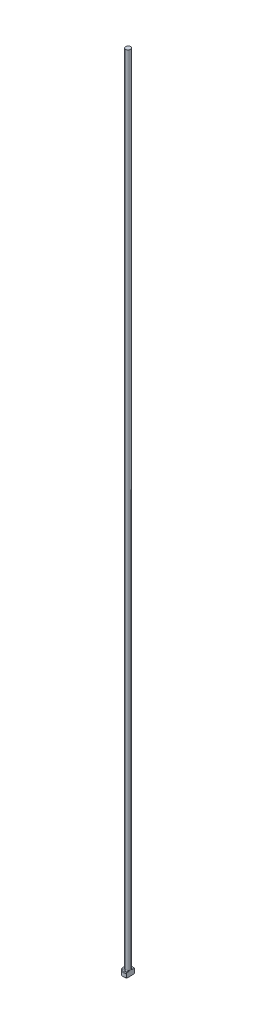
ISO-10303-21;
HEADER;
FILE_DESCRIPTION(('STEP AP214'),'2;1');
FILE_NAME('part.step','',(''),(''),'','','');
FILE_SCHEMA(('AUTOMOTIVE_DESIGN { 1 0 10303 214 1 1 1 1 }'));
ENDSEC;
DATA;
#1=APPLICATION_CONTEXT('core data for automotive mechanical design processes');
#2=APPLICATION_PROTOCOL_DEFINITION('international standard','automotive_design',2000,#1);
#3=PRODUCT_CONTEXT('',#1,'mechanical');
#4=PRODUCT('Part','Part','',(#3));
#5=PRODUCT_RELATED_PRODUCT_CATEGORY('part','',(#4));
#6=PRODUCT_DEFINITION_FORMATION('','',#4);
#7=PRODUCT_DEFINITION_CONTEXT('part definition',#1,'design');
#8=PRODUCT_DEFINITION('design','',#6,#7);
#9=PRODUCT_DEFINITION_SHAPE('','',#8);
#10=(LENGTH_UNIT() NAMED_UNIT(*) SI_UNIT(.MILLI.,.METRE.));
#11=(NAMED_UNIT(*) PLANE_ANGLE_UNIT() SI_UNIT($,.RADIAN.));
#12=(NAMED_UNIT(*) SI_UNIT($,.STERADIAN.) SOLID_ANGLE_UNIT());
#13=UNCERTAINTY_MEASURE_WITH_UNIT(LENGTH_MEASURE(1.E-05),#10,'distance_accuracy_value','');
#14=(GEOMETRIC_REPRESENTATION_CONTEXT(3) GLOBAL_UNCERTAINTY_ASSIGNED_CONTEXT((#13)) GLOBAL_UNIT_ASSIGNED_CONTEXT((#10,
#11,#12)) REPRESENTATION_CONTEXT('',''));
#15=CARTESIAN_POINT('',(0.,0.,0.));
#16=DIRECTION('',(0.,0.,1.));
#17=DIRECTION('',(1.,0.,0.));
#18=AXIS2_PLACEMENT_3D('',#15,#16,#17);
#19=CARTESIAN_POINT('',(0.,0.,0.));
#20=DIRECTION('',(0.,-1.,0.));
#21=DIRECTION('',(0.,0.,-1.));
#22=AXIS2_PLACEMENT_3D('',#19,#20,#21);
#23=PLANE('',#22);
#24=CARTESIAN_POINT('',(0.,0.,0.));
#25=DIRECTION('',(0.,-1.,0.));
#26=DIRECTION('',(0.,0.,-1.));
#27=AXIS2_PLACEMENT_3D('',#24,#25,#26);
#28=CIRCLE('',#27,1.29999999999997);
#29=CARTESIAN_POINT('',(0.749999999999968,0.,1.06183802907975));
#30=VERTEX_POINT('',#29);
#31=CARTESIAN_POINT('',(0.749999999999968,0.,-1.06183802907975));
#32=VERTEX_POINT('',#31);
#33=EDGE_CURVE('E98',#30,#32,#28,.T.);
#34=ORIENTED_EDGE('',*,*,#33,.T.);
#35=DIRECTION('',(0.,0.,1.));
#36=VECTOR('',#35,1.);
#37=CARTESIAN_POINT('',(0.749999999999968,0.,-1.29903810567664));
#38=LINE('',#37,#36);
#39=EDGE_CURVE('E83',#32,#30,#38,.T.);
#40=ORIENTED_EDGE('',*,*,#39,.T.);
#41=EDGE_LOOP('',(#34,#40));
#42=FACE_BOUND('',#41,.T.);
#43=ADVANCED_FACE('F32',(#42),#23,.T.);
#44=CARTESIAN_POINT('',(0.,259.958771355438,0.));
#45=DIRECTION('',(0.,1.,0.));
#46=DIRECTION('',(0.,0.,1.));
#47=AXIS2_PLACEMENT_3D('',#44,#45,#46);
#48=CYLINDRICAL_SURFACE('',#47,1.49999999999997);
#49=CARTESIAN_POINT('',(0.,1.29999999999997,0.));
#50=DIRECTION('',(0.,1.,0.));
#51=DIRECTION('',(0.,0.,1.));
#52=AXIS2_PLACEMENT_3D('',#49,#50,#51);
#53=CIRCLE('',#52,1.49999999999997);
#54=CARTESIAN_POINT('',(0.749999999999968,1.29999999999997,1.29903810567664));
#55=VERTEX_POINT('',#54);
#56=CARTESIAN_POINT('',(0.749999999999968,1.29999999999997,-1.29903810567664));
#57=VERTEX_POINT('',#56);
#58=EDGE_CURVE('E104',#55,#57,#53,.F.);
#59=ORIENTED_EDGE('',*,*,#58,.T.);
#60=DIRECTION('',(0.,-1.,0.));
#61=VECTOR('',#60,1.);
#62=CARTESIAN_POINT('',(0.749999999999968,250.,-1.29903810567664));
#63=LINE('',#62,#61);
#64=CARTESIAN_POINT('',(0.749999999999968,0.199999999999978,-1.29903810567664));
#65=VERTEX_POINT('',#64);
#66=EDGE_CURVE('E183',#57,#65,#63,.T.);
#67=ORIENTED_EDGE('',*,*,#66,.T.);
#68=CARTESIAN_POINT('',(0.,0.199999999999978,0.));
#69=DIRECTION('',(0.,-1.,0.));
#70=DIRECTION('',(0.,0.,-1.));
#71=AXIS2_PLACEMENT_3D('',#68,#69,#70);
#72=CIRCLE('',#71,1.49999999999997);
#73=CARTESIAN_POINT('',(0.749999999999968,0.199999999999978,1.29903810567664));
#74=VERTEX_POINT('',#73);
#75=EDGE_CURVE('E100',#65,#74,#72,.F.);
#76=ORIENTED_EDGE('',*,*,#75,.T.);
#77=DIRECTION('',(0.,-1.,0.));
#78=VECTOR('',#77,1.);
#79=CARTESIAN_POINT('',(0.749999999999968,250.,1.29903810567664));
#80=LINE('',#79,#78);
#81=EDGE_CURVE('E93',#55,#74,#80,.T.);
#82=ORIENTED_EDGE('',*,*,#81,.F.);
#83=EDGE_LOOP('',(#59,#67,#76,#82));
#84=FACE_BOUND('',#83,.T.);
#85=ADVANCED_FACE('F158',(#84),#48,.T.);
#86=CARTESIAN_POINT('',(-1.49999999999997,1.5,0.));
#87=DIRECTION('',(0.,1.,0.));
#88=DIRECTION('',(0.,0.,1.));
#89=AXIS2_PLACEMENT_3D('',#86,#87,#88);
#90=PLANE('',#89);
#91=CARTESIAN_POINT('',(0.,1.5,0.));
#92=DIRECTION('',(0.,1.,0.));
#93=DIRECTION('',(0.,0.,1.));
#94=AXIS2_PLACEMENT_3D('',#91,#92,#93);
#95=CIRCLE('',#94,1.29999999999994);
#96=CARTESIAN_POINT('',(0.749999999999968,1.5,-1.06183802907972));
#97=VERTEX_POINT('',#96);
#98=CARTESIAN_POINT('',(0.749999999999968,1.5,1.06183802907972));
#99=VERTEX_POINT('',#98);
#100=EDGE_CURVE('E178',#97,#99,#95,.T.);
#101=ORIENTED_EDGE('',*,*,#100,.T.);
#102=DIRECTION('',(0.,0.,-1.));
#103=VECTOR('',#102,1.);
#104=CARTESIAN_POINT('',(0.749999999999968,1.5,0.));
#105=LINE('',#104,#103);
#106=CARTESIAN_POINT('',(0.749999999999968,1.49999999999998,0.583095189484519));
#107=VERTEX_POINT('',#106);
#108=EDGE_CURVE('E57',#99,#107,#105,.T.);
#109=ORIENTED_EDGE('',*,*,#108,.T.);
#110=CARTESIAN_POINT('',(0.,1.5,0.));
#111=DIRECTION('',(0.,1.,0.));
#112=DIRECTION('',(0.,0.,1.));
#113=AXIS2_PLACEMENT_3D('',#110,#111,#112);
#114=CIRCLE('',#113,0.949999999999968);
#115=CARTESIAN_POINT('',(0.749999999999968,1.49999999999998,-0.583095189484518));
#116=VERTEX_POINT('',#115);
#117=EDGE_CURVE('E107',#107,#116,#114,.F.);
#118=ORIENTED_EDGE('',*,*,#117,.T.);
#119=EDGE_CURVE('E136',#116,#97,#105,.T.);
#120=ORIENTED_EDGE('',*,*,#119,.T.);
#121=EDGE_LOOP('',(#101,#109,#118,#120));
#122=FACE_BOUND('',#121,.T.);
#123=ADVANCED_FACE('F147',(#122),#90,.T.);
#124=CARTESIAN_POINT('',(0.,1.5,0.));
#125=DIRECTION('',(0.,-1.,0.));
#126=DIRECTION('',(0.,0.,-1.));
#127=AXIS2_PLACEMENT_3D('',#124,#125,#126);
#128=CONICAL_SURFACE('',#127,1.29999999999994,0.785398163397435);
#129=ORIENTED_EDGE('',*,*,#58,.F.);
#130=CARTESIAN_POINT('',(0.749999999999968,-0.159311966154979,2.86269581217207));
#131=CARTESIAN_POINT('',(0.749999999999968,-0.0964328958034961,2.79769204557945));
#132=CARTESIAN_POINT('',(0.749999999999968,-0.033622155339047,2.73262201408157));
#133=CARTESIAN_POINT('',(0.749999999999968,0.0918244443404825,2.60231208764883));
#134=CARTESIAN_POINT('',(0.749999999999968,0.154460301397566,2.53707219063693));
#135=CARTESIAN_POINT('',(0.749999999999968,0.342109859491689,2.34097725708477));
#136=CARTESIAN_POINT('',(0.749999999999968,0.466801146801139,2.20981339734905));
#137=CARTESIAN_POINT('',(0.749999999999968,0.712328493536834,1.9488034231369));
#138=CARTESIAN_POINT('',(0.749999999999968,0.833191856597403,1.81898315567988));
#139=CARTESIAN_POINT('',(0.749999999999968,1.01264761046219,1.62259577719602));
#140=CARTESIAN_POINT('',(0.749999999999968,1.07215326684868,1.55686440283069));
#141=CARTESIAN_POINT('',(0.749999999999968,1.19029260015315,1.42462307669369));
#142=CARTESIAN_POINT('',(0.749999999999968,1.24892630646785,1.35811315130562));
#143=CARTESIAN_POINT('',(0.749999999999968,1.34237202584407,1.25003987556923));
#144=CARTESIAN_POINT('',(0.749999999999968,1.37758720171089,1.20882554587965));
#145=CARTESIAN_POINT('',(0.749999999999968,1.44738925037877,1.12585980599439));
#146=CARTESIAN_POINT('',(0.749999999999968,1.48197606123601,1.08410834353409));
#147=CARTESIAN_POINT('',(0.749999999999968,1.55066668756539,0.999475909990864));
#148=CARTESIAN_POINT('',(0.749999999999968,1.58476158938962,0.956587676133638));
#149=CARTESIAN_POINT('',(0.749999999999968,1.65176028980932,0.869892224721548));
#150=CARTESIAN_POINT('',(0.749999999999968,1.68466421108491,0.826085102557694));
#151=CARTESIAN_POINT('',(0.749999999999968,1.74926316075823,0.736563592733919));
#152=CARTESIAN_POINT('',(0.749999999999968,1.78093229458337,0.690830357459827));
#153=CARTESIAN_POINT('',(0.749999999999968,1.84170221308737,0.597569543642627));
#154=CARTESIAN_POINT('',(0.749999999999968,1.87079946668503,0.550039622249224));
#155=CARTESIAN_POINT('',(0.749999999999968,1.92458416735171,0.45327502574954));
#156=CARTESIAN_POINT('',(0.749999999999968,1.94932190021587,0.404068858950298));
#157=CARTESIAN_POINT('',(0.749999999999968,1.9924017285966,0.302953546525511));
#158=CARTESIAN_POINT('',(0.749999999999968,2.01076529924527,0.251054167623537));
#159=CARTESIAN_POINT('',(0.749999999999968,2.03062801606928,0.173219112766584));
#160=CARTESIAN_POINT('',(0.749999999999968,2.03589389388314,0.148243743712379));
#161=CARTESIAN_POINT('',(0.749999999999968,2.04404463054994,0.0979002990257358));
#162=CARTESIAN_POINT('',(0.749999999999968,2.04692969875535,0.0725322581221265));
#163=CARTESIAN_POINT('',(0.749999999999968,2.05011277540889,0.0217085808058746));
#164=CARTESIAN_POINT('',(0.749999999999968,2.05041870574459,-0.0037465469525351));
#165=CARTESIAN_POINT('',(0.749999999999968,2.04844884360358,-0.054551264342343));
#166=CARTESIAN_POINT('',(0.749999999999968,2.04617283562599,-0.0799008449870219));
#167=CARTESIAN_POINT('',(0.749999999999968,2.03574038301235,-0.154989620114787));
#168=CARTESIAN_POINT('',(0.749999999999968,2.02400532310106,-0.204255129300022));
#169=CARTESIAN_POINT('',(0.749999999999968,2.00101199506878,-0.276434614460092));
#170=CARTESIAN_POINT('',(0.749999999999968,1.99241146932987,-0.300284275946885));
#171=CARTESIAN_POINT('',(0.749999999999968,1.97373056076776,-0.347397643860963));
#172=CARTESIAN_POINT('',(0.749999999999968,1.96365048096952,-0.37066146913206));
#173=CARTESIAN_POINT('',(0.749999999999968,1.93147369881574,-0.439916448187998));
#174=CARTESIAN_POINT('',(0.749999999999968,1.90754987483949,-0.485052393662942));
#175=CARTESIAN_POINT('',(0.749999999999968,1.85653851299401,-0.573518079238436));
#176=CARTESIAN_POINT('',(0.749999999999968,1.8294470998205,-0.616845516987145));
#177=CARTESIAN_POINT('',(0.749999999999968,1.77305281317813,-0.702247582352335));
#178=CARTESIAN_POINT('',(0.749999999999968,1.74374234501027,-0.744317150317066));
#179=CARTESIAN_POINT('',(0.749999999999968,1.68364081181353,-0.827390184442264));
#180=CARTESIAN_POINT('',(0.749999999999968,1.65284939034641,-0.868393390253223));
#181=CARTESIAN_POINT('',(0.749999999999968,1.5581158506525,-0.991236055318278));
#182=CARTESIAN_POINT('',(0.749999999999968,1.49256261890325,-1.07182756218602));
#183=CARTESIAN_POINT('',(0.749999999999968,1.35929153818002,-1.23084604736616));
#184=CARTESIAN_POINT('',(0.749999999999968,1.29157909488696,-1.30927763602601));
#185=CARTESIAN_POINT('',(0.749999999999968,1.16634991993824,-1.45163734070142));
#186=CARTESIAN_POINT('',(0.749999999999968,1.10905780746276,-1.51576342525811));
#187=CARTESIAN_POINT('',(0.749999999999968,0.993771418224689,-1.64338257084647));
#188=CARTESIAN_POINT('',(0.749999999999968,0.935777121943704,-1.70687561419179));
#189=CARTESIAN_POINT('',(0.749999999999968,0.760930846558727,-1.89677871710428));
#190=CARTESIAN_POINT('',(0.749999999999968,0.643323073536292,-2.02249209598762));
#191=CARTESIAN_POINT('',(0.749999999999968,0.411828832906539,-2.26768837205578));
#192=CARTESIAN_POINT('',(0.749999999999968,0.297988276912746,-2.3872148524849));
#193=CARTESIAN_POINT('',(0.749999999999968,0.0697231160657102,-2.62545352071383));
#194=CARTESIAN_POINT('',(0.749999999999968,-0.0447006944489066,-2.74416646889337));
#195=CARTESIAN_POINT('',(0.749999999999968,-0.159311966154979,-2.86269581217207));
#196=B_SPLINE_CURVE_WITH_KNOTS('',3,(#130,#131,#132,#133,#134,#135,#136,#137,#138,#139,#140,
#141,#142,#143,#144,#145,#146,#147,#148,#149,#150,#151,#152,#153,#154,#155,#156,#157,#158,#159,
#160,#161,#162,#163,#164,#165,#166,#167,#168,#169,#170,#171,#172,#173,#174,#175,#176,#177,#178,
#179,#180,#181,#182,#183,#184,#185,#186,#187,#188,#189,#190,#191,#192,#193,#194,#195),
.UNSPECIFIED.,.F.,.F.,(4,2,2,2,2,2,2,2,2,2,2,2,2,2,2,2,2,2,2,2,2,2,2,2,2,2,2,2,2,2,2,2,4),(0.,
0.271318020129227,0.54263937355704,1.08555961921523,1.61765797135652,1.88364922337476,
2.14963148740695,2.31225703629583,2.47489853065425,2.63925165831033,2.80358780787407,
2.9704157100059,3.13746921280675,3.30244771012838,3.46686485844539,3.54334114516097,
3.61981070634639,3.69604530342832,3.77228626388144,3.9233329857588,3.99936293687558,
4.07537733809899,4.22841106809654,4.38163402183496,4.53540740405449,4.68921798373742,
5.0007773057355,5.31160990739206,5.56957672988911,5.82755073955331,6.34398366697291,
6.83917444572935,7.33381214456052),.UNSPECIFIED.);
#197=EDGE_CURVE('E135',#55,#99,#196,.T.);
#198=ORIENTED_EDGE('',*,*,#197,.T.);
#199=ORIENTED_EDGE('',*,*,#100,.F.);
#200=EDGE_CURVE('E127',#97,#57,#196,.T.);
#201=ORIENTED_EDGE('',*,*,#200,.T.);
#202=EDGE_LOOP('',(#129,#198,#199,#201));
#203=FACE_BOUND('',#202,.T.);
#204=ADVANCED_FACE('F143',(#203),#128,.T.);
#205=CARTESIAN_POINT('',(0.,0.199999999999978,0.));
#206=DIRECTION('',(0.,1.,0.));
#207=DIRECTION('',(0.,0.,1.));
#208=AXIS2_PLACEMENT_3D('',#205,#206,#207);
#209=CONICAL_SURFACE('',#208,1.49999999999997,0.785398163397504);
#210=ORIENTED_EDGE('',*,*,#75,.F.);
#211=CARTESIAN_POINT('',(0.749999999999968,1.65931196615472,-2.86269581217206));
#212=CARTESIAN_POINT('',(0.749999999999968,1.59643289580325,-2.79769204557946));
#213=CARTESIAN_POINT('',(0.749999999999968,1.53362215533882,-2.73262201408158));
#214=CARTESIAN_POINT('',(0.749999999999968,1.40817555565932,-2.60231208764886));
#215=CARTESIAN_POINT('',(0.749999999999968,1.34553969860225,-2.53707219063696));
#216=CARTESIAN_POINT('',(0.749999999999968,1.15789014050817,-2.34097725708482));
#217=CARTESIAN_POINT('',(0.749999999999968,1.03319885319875,-2.20981339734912));
#218=CARTESIAN_POINT('',(0.749999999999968,0.787671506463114,-1.94880342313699));
#219=CARTESIAN_POINT('',(0.749999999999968,0.666808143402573,-1.81898315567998));
#220=CARTESIAN_POINT('',(0.749999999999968,0.487352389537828,-1.62259577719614));
#221=CARTESIAN_POINT('',(0.749999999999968,0.427846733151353,-1.55686440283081));
#222=CARTESIAN_POINT('',(0.749999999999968,0.309707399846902,-1.42462307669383));
#223=CARTESIAN_POINT('',(0.749999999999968,0.251073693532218,-1.35811315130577));
#224=CARTESIAN_POINT('',(0.749999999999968,0.157627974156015,-1.25003987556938));
#225=CARTESIAN_POINT('',(0.749999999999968,0.122412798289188,-1.2088255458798));
#226=CARTESIAN_POINT('',(0.749999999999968,0.0526107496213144,-1.12585980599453));
#227=CARTESIAN_POINT('',(0.749999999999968,0.0180239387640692,-1.08410834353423));
#228=CARTESIAN_POINT('',(0.749999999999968,-0.0506666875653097,-0.999475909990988));
#229=CARTESIAN_POINT('',(0.749999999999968,-0.0847615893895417,-0.956587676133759));
#230=CARTESIAN_POINT('',(0.749999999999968,-0.151760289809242,-0.869892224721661));
#231=CARTESIAN_POINT('',(0.749999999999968,-0.184664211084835,-0.826085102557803));
#232=CARTESIAN_POINT('',(0.749999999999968,-0.249263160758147,-0.73656359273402));
#233=CARTESIAN_POINT('',(0.749999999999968,-0.280932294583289,-0.690830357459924));
#234=CARTESIAN_POINT('',(0.749999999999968,-0.341702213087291,-0.597569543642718));
#235=CARTESIAN_POINT('',(0.749999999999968,-0.370799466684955,-0.550039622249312));
#236=CARTESIAN_POINT('',(0.749999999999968,-0.424584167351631,-0.453275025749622));
#237=CARTESIAN_POINT('',(0.749999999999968,-0.449321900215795,-0.404068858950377));
#238=CARTESIAN_POINT('',(0.749999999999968,-0.492401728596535,-0.302953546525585));
#239=CARTESIAN_POINT('',(0.749999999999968,-0.510765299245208,-0.251054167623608));
#240=CARTESIAN_POINT('',(0.749999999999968,-0.530628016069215,-0.173219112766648));
#241=CARTESIAN_POINT('',(0.749999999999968,-0.53589389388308,-0.148243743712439));
#242=CARTESIAN_POINT('',(0.749999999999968,-0.54404463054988,-0.0979002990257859));
#243=CARTESIAN_POINT('',(0.749999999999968,-0.546929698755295,-0.0725322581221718));
#244=CARTESIAN_POINT('',(0.749999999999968,-0.550112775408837,-0.0217085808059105));
#245=CARTESIAN_POINT('',(0.749999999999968,-0.550418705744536,0.00374654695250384));
#246=CARTESIAN_POINT('',(0.749999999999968,-0.548448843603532,0.0545512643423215));
#247=CARTESIAN_POINT('',(0.749999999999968,-0.546172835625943,0.0799008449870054));
#248=CARTESIAN_POINT('',(0.749999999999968,-0.535740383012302,0.154989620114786));
#249=CARTESIAN_POINT('',(0.749999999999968,-0.524005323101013,0.204255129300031));
#250=CARTESIAN_POINT('',(0.749999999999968,-0.501011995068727,0.276434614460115));
#251=CARTESIAN_POINT('',(0.749999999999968,-0.492411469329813,0.300284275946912));
#252=CARTESIAN_POINT('',(0.749999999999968,-0.473730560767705,0.347397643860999));
#253=CARTESIAN_POINT('',(0.749999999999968,-0.463650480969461,0.370661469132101));
#254=CARTESIAN_POINT('',(0.749999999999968,-0.431473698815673,0.439916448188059));
#255=CARTESIAN_POINT('',(0.749999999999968,-0.407549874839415,0.485052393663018));
#256=CARTESIAN_POINT('',(0.749999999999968,-0.356538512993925,0.57351807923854));
#257=CARTESIAN_POINT('',(0.749999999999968,-0.329447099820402,0.616845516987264));
#258=CARTESIAN_POINT('',(0.749999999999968,-0.273052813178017,0.702247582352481));
#259=CARTESIAN_POINT('',(0.749999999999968,-0.24374234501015,0.744317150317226));
#260=CARTESIAN_POINT('',(0.749999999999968,-0.183640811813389,0.827390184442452));
#261=CARTESIAN_POINT('',(0.749999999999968,-0.152849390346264,0.868393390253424));
#262=CARTESIAN_POINT('',(0.749999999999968,-0.0581158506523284,0.991236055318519));
#263=CARTESIAN_POINT('',(0.749999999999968,0.00743738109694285,1.07182756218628));
#264=CARTESIAN_POINT('',(0.749999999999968,0.140708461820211,1.23084604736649));
#265=CARTESIAN_POINT('',(0.749999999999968,0.208420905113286,1.30927763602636));
#266=CARTESIAN_POINT('',(0.749999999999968,0.333650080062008,1.45163734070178));
#267=CARTESIAN_POINT('',(0.749999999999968,0.390942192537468,1.51576342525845));
#268=CARTESIAN_POINT('',(0.749999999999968,0.506228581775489,1.64338257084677));
#269=CARTESIAN_POINT('',(0.749999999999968,0.564222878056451,1.70687561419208));
#270=CARTESIAN_POINT('',(0.749999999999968,0.73906915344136,1.89677871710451));
#271=CARTESIAN_POINT('',(0.749999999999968,0.856676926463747,2.02249209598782));
#272=CARTESIAN_POINT('',(0.749999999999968,1.08817116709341,2.26768837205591));
#273=CARTESIAN_POINT('',(0.749999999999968,1.20201172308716,2.38721485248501));
#274=CARTESIAN_POINT('',(0.749999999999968,1.43027688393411,2.62545352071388));
#275=CARTESIAN_POINT('',(0.749999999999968,1.54470069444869,2.7441664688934));
#276=CARTESIAN_POINT('',(0.749999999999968,1.65931196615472,2.86269581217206));
#277=B_SPLINE_CURVE_WITH_KNOTS('',3,(#211,#212,#213,#214,#215,#216,#217,#218,#219,#220,#221,
#222,#223,#224,#225,#226,#227,#228,#229,#230,#231,#232,#233,#234,#235,#236,#237,#238,#239,#240,
#241,#242,#243,#244,#245,#246,#247,#248,#249,#250,#251,#252,#253,#254,#255,#256,#257,#258,#259,
#260,#261,#262,#263,#264,#265,#266,#267,#268,#269,#270,#271,#272,#273,#274,#275,#276),
.UNSPECIFIED.,.F.,.F.,(4,2,2,2,2,2,2,2,2,2,2,2,2,2,2,2,2,2,2,2,2,2,2,2,2,2,2,2,2,2,2,2,4),(0.,
0.271318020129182,0.542639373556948,1.08555961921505,1.61765797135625,1.88364922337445,
2.1496314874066,2.31225703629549,2.47489853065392,2.63925165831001,2.80358780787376,
2.9704157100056,3.13746921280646,3.3024477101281,3.46686485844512,3.54334114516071,
3.61981070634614,3.69604530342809,3.77228626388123,3.92333298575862,3.99936293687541,
4.07537733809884,4.22841106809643,4.3816340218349,4.53540740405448,4.68921798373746,
5.00077730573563,5.3116099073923,5.56957672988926,5.82755073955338,6.3439836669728,
6.83917444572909,7.33381214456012),.UNSPECIFIED.);
#278=EDGE_CURVE('E86',#65,#32,#277,.T.);
#279=ORIENTED_EDGE('',*,*,#278,.T.);
#280=ORIENTED_EDGE('',*,*,#33,.F.);
#281=EDGE_CURVE('E89',#30,#74,#277,.T.);
#282=ORIENTED_EDGE('',*,*,#281,.T.);
#283=EDGE_LOOP('',(#210,#279,#280,#282));
#284=FACE_BOUND('',#283,.T.);
#285=ADVANCED_FACE('F97',(#284),#209,.T.);
#286=CARTESIAN_POINT('',(0.,1.69999999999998,0.));
#287=DIRECTION('',(0.,1.,0.));
#288=DIRECTION('',(0.,0.,1.));
#289=AXIS2_PLACEMENT_3D('',#286,#287,#288);
#290=TOROIDAL_SURFACE('',#289,0.949999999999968,0.2);
#291=CARTESIAN_POINT('',(0.749999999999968,1.69999999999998,0.));
#292=CARTESIAN_POINT('',(0.749999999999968,1.70000052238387,0.));
#293=CARTESIAN_POINT('',(0.749999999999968,1.70000104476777,-7.92518426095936E-08));
#294=CARTESIAN_POINT('',(0.749999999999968,1.70000206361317,-3.45345029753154E-07));
#295=CARTESIAN_POINT('',(0.749999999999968,1.70000255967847,-5.3349315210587E-07));
#296=CARTESIAN_POINT('',(0.749999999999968,1.70000354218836,-9.91557921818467E-07));
#297=CARTESIAN_POINT('',(0.749999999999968,1.70000402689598,-1.26510931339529E-06));
#298=CARTESIAN_POINT('',(0.749999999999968,1.70000495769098,-1.86638896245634E-06));
#299=CARTESIAN_POINT('',(0.749999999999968,1.70000540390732,-2.19392466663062E-06));
#300=CARTESIAN_POINT('',(0.749999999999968,1.70000683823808,-3.33370952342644E-06));
#301=CARTESIAN_POINT('',(0.749999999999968,1.70000776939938,-4.21820142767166E-06));
#302=CARTESIAN_POINT('',(0.749999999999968,1.70000948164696,-6.08403165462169E-06));
#303=CARTESIAN_POINT('',(0.749999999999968,1.70001026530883,-7.06314143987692E-06));
#304=CARTESIAN_POINT('',(0.749999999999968,1.70001305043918,-1.07283299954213E-05));
#305=CARTESIAN_POINT('',(0.749999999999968,1.70001489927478,-1.35334970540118E-05));
#306=CARTESIAN_POINT('',(0.749999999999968,1.70001806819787,-1.91887701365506E-05));
#307=CARTESIAN_POINT('',(0.749999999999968,1.70001941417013,-2.20250297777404E-05));
#308=CARTESIAN_POINT('',(0.749999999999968,1.700024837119,-3.36357626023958E-05));
#309=CARTESIAN_POINT('',(0.749999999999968,1.70002876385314,-4.24755661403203E-05));
#310=CARTESIAN_POINT('',(0.749999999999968,1.70003535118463,-5.93015818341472E-05));
#311=CARTESIAN_POINT('',(0.749999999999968,1.70003811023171,-6.72480836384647E-05));
#312=CARTESIAN_POINT('',(0.749999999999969,1.70005910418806,-0.000122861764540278));
#313=CARTESIAN_POINT('',(0.749999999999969,1.7000847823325,-0.000167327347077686));
#314=CARTESIAN_POINT('',(0.749999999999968,1.70017912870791,-0.000337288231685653));
#315=CARTESIAN_POINT('',(0.749999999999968,1.70024226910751,-0.000465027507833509));
#316=CARTESIAN_POINT('',(0.749999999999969,1.70048606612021,-0.000950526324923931));
#317=CARTESIAN_POINT('',(0.749999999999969,1.70067249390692,-0.00130597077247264));
#318=CARTESIAN_POINT('',(0.749999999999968,1.70141452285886,-0.00272815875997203));
#319=CARTESIAN_POINT('',(0.749999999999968,1.70196367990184,-0.00379745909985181));
#320=CARTESIAN_POINT('',(0.749999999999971,1.71079317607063,-0.0209810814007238));
#321=CARTESIAN_POINT('',(0.749999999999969,1.71912708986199,-0.0370747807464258));
#322=CARTESIAN_POINT('',(0.749999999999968,1.7353816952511,-0.068794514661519));
#323=CARTESIAN_POINT('',(0.749999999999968,1.74330692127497,-0.0844183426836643));
#324=CARTESIAN_POINT('',(0.749999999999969,1.75980152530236,-0.11741223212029));
#325=CARTESIAN_POINT('',(0.749999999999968,1.76835063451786,-0.134792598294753));
#326=CARTESIAN_POINT('',(0.749999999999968,1.7851625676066,-0.169887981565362));
#327=CARTESIAN_POINT('',(0.749999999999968,1.79342203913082,-0.187604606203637));
#328=CARTESIAN_POINT('',(0.749999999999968,1.81367684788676,-0.232718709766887));
#329=CARTESIAN_POINT('',(0.749999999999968,1.82533268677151,-0.260271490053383));
#330=CARTESIAN_POINT('',(0.749999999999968,1.84666110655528,-0.315501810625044));
#331=CARTESIAN_POINT('',(0.749999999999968,1.85636938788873,-0.34316526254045));
#332=CARTESIAN_POINT('',(0.749999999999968,1.87268127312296,-0.396748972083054));
#333=CARTESIAN_POINT('',(0.749999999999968,1.87948325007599,-0.42260763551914));
#334=CARTESIAN_POINT('',(0.749999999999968,1.89076706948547,-0.476103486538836));
#335=CARTESIAN_POINT('',(0.749999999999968,1.89512718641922,-0.50376764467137));
#336=CARTESIAN_POINT('',(0.749999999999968,1.90012258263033,-0.559350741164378));
#337=CARTESIAN_POINT('',(0.749999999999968,1.90077276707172,-0.587268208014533));
#338=CARTESIAN_POINT('',(0.749999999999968,1.8972553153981,-0.64249646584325));
#339=CARTESIAN_POINT('',(0.749999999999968,1.89315871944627,-0.669810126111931));
#340=CARTESIAN_POINT('',(0.749999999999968,1.88226759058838,-0.710376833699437));
#341=CARTESIAN_POINT('',(0.749999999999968,1.87764112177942,-0.724213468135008));
#342=CARTESIAN_POINT('',(0.749999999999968,1.8664543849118,-0.751128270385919));
#343=CARTESIAN_POINT('',(0.749999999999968,1.85989169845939,-0.764205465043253));
#344=CARTESIAN_POINT('',(0.749999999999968,1.84591711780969,-0.787020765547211));
#345=CARTESIAN_POINT('',(0.749999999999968,1.83882518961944,-0.796953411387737));
#346=CARTESIAN_POINT('',(0.749999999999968,1.82312129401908,-0.815534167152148));
#347=CARTESIAN_POINT('',(0.749999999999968,1.81451194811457,-0.824184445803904));
#348=CARTESIAN_POINT('',(0.749999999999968,1.79770708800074,-0.838172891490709));
#349=CARTESIAN_POINT('',(0.749999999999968,1.78977561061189,-0.84382734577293));
#350=CARTESIAN_POINT('',(0.749999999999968,1.77308433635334,-0.853755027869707));
#351=CARTESIAN_POINT('',(0.749999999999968,1.76432487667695,-0.858028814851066));
#352=CARTESIAN_POINT('',(0.749999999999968,1.74611994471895,-0.864966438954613));
#353=CARTESIAN_POINT('',(0.749999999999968,1.73667052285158,-0.867620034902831));
#354=CARTESIAN_POINT('',(0.749999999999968,1.71743927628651,-0.871086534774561));
#355=CARTESIAN_POINT('',(0.749999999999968,1.70765762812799,-0.871900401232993));
#356=CARTESIAN_POINT('',(0.749999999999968,1.68916476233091,-0.871644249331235));
#357=CARTESIAN_POINT('',(0.749999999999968,1.68045031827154,-0.870765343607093));
#358=CARTESIAN_POINT('',(0.749999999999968,1.66329782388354,-0.867547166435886));
#359=CARTESIAN_POINT('',(0.749999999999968,1.65485975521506,-0.865207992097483));
#360=CARTESIAN_POINT('',(0.749999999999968,1.63851016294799,-0.859212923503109));
#361=CARTESIAN_POINT('',(0.749999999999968,1.63059660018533,-0.855562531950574));
#362=CARTESIAN_POINT('',(0.749999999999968,1.61540880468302,-0.847119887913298));
#363=CARTESIAN_POINT('',(0.749999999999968,1.60813470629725,-0.842327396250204));
#364=CARTESIAN_POINT('',(0.749999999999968,1.59350795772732,-0.831172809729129));
#365=CARTESIAN_POINT('',(0.749999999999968,1.58624574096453,-0.82469266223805));
#366=CARTESIAN_POINT('',(0.749999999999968,1.57268239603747,-0.810794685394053));
#367=CARTESIAN_POINT('',(0.749999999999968,1.56638225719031,-0.803375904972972));
#368=CARTESIAN_POINT('',(0.749999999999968,1.55147186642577,-0.783446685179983));
#369=CARTESIAN_POINT('',(0.749999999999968,1.54355238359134,-0.770417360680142));
#370=CARTESIAN_POINT('',(0.749999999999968,1.52991429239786,-0.743286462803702));
#371=CARTESIAN_POINT('',(0.749999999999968,1.52419651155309,-0.729184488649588));
#372=CARTESIAN_POINT('',(0.749999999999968,1.51257018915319,-0.693822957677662));
#373=CARTESIAN_POINT('',(0.749999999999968,1.50774380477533,-0.672209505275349));
#374=CARTESIAN_POINT('',(0.749999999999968,1.50145191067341,-0.628298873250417));
#375=CARTESIAN_POINT('',(0.749999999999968,1.5000267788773,-0.605996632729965));
#376=CARTESIAN_POINT('',(0.749999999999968,1.49995578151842,-0.546111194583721));
#377=CARTESIAN_POINT('',(0.749999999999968,1.50388309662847,-0.508527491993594));
#378=CARTESIAN_POINT('',(0.749999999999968,1.51373246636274,-0.453837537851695));
#379=CARTESIAN_POINT('',(0.749999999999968,1.51754666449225,-0.436272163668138));
#380=CARTESIAN_POINT('',(0.749999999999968,1.52621031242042,-0.401484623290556));
#381=CARTESIAN_POINT('',(0.749999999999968,1.53105449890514,-0.384261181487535));
#382=CARTESIAN_POINT('',(0.749999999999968,1.54486296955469,-0.339542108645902));
#383=CARTESIAN_POINT('',(0.749999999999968,1.55452531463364,-0.312264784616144));
#384=CARTESIAN_POINT('',(0.749999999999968,1.57570310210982,-0.257776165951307));
#385=CARTESIAN_POINT('',(0.749999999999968,1.58725400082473,-0.230578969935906));
#386=CARTESIAN_POINT('',(0.749999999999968,1.60733071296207,-0.18597536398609));
#387=CARTESIAN_POINT('',(0.749999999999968,1.6155301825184,-0.168419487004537));
#388=CARTESIAN_POINT('',(0.749999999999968,1.63221303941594,-0.133639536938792));
#389=CARTESIAN_POINT('',(0.749999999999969,1.64069316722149,-0.116413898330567));
#390=CARTESIAN_POINT('',(0.749999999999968,1.65705001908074,-0.0837133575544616));
#391=CARTESIAN_POINT('',(0.749999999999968,1.66490699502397,-0.0682284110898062));
#392=CARTESIAN_POINT('',(0.749999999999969,1.68101978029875,-0.0367899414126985));
#393=CARTESIAN_POINT('',(0.749999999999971,1.68928002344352,-0.0208385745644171));
#394=CARTESIAN_POINT('',(0.749999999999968,1.69803632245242,-0.00379745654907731));
#395=CARTESIAN_POINT('',(0.749999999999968,1.69858548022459,-0.00272815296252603));
#396=CARTESIAN_POINT('',(0.749999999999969,1.69932750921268,-0.00130596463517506));
#397=CARTESIAN_POINT('',(0.749999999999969,1.69951393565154,-0.000950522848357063));
#398=CARTESIAN_POINT('',(0.749999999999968,1.69975773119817,-0.000465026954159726));
#399=CARTESIAN_POINT('',(0.749999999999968,1.6998208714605,-0.000337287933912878));
#400=CARTESIAN_POINT('',(0.749999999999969,1.69991521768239,-0.00016732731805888));
#401=CARTESIAN_POINT('',(0.749999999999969,1.69994089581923,-0.000122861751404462));
#402=CARTESIAN_POINT('',(0.749999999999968,1.69996188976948,-6.72480869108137E-05));
#403=CARTESIAN_POINT('',(0.749999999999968,1.69996464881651,-5.93015849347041E-05));
#404=CARTESIAN_POINT('',(0.749999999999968,1.6999712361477,-4.24755687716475E-05));
#405=CARTESIAN_POINT('',(0.749999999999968,1.69997516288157,-3.36357649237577E-05));
#406=CARTESIAN_POINT('',(0.749999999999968,1.69998058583,-2.20250315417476E-05));
#407=CARTESIAN_POINT('',(0.749999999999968,1.69998193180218,-1.91887716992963E-05));
#408=CARTESIAN_POINT('',(0.749999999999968,1.69998510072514,-1.35334981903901E-05));
#409=CARTESIAN_POINT('',(0.749999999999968,1.69998694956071,-1.07283309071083E-05));
#410=CARTESIAN_POINT('',(0.749999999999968,1.69998973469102,-7.06314205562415E-06));
#411=CARTESIAN_POINT('',(0.749999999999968,1.69999051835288,-6.08403219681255E-06));
#412=CARTESIAN_POINT('',(0.749999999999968,1.69999223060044,-4.21820182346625E-06));
#413=CARTESIAN_POINT('',(0.749999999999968,1.69999316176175,-3.33370984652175E-06));
#414=CARTESIAN_POINT('',(0.749999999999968,1.69999459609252,-2.19392489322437E-06));
#415=CARTESIAN_POINT('',(0.749999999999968,1.69999504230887,-1.86638916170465E-06));
#416=CARTESIAN_POINT('',(0.749999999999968,1.69999597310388,-1.26510946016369E-06));
#417=CARTESIAN_POINT('',(0.749999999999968,1.69999645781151,-9.91558043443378E-07));
#418=CARTESIAN_POINT('',(0.749999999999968,1.69999744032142,-5.33493228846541E-07));
#419=CARTESIAN_POINT('',(0.749999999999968,1.69999793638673,-3.453450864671E-07));
#420=CARTESIAN_POINT('',(0.749999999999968,1.69999895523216,-7.92518654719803E-08));
#421=CARTESIAN_POINT('',(0.749999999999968,1.69999947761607,0.));
#422=CARTESIAN_POINT('',(0.749999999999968,1.69999999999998,0.));
#423=B_SPLINE_CURVE_WITH_KNOTS('',3,(#291,#292,#293,#294,#295,#296,#297,#298,#299,#300,#301,
#302,#303,#304,#305,#306,#307,#308,#309,#310,#311,#312,#313,#314,#315,#316,#317,#318,#319,#320,
#321,#322,#323,#324,#325,#326,#327,#328,#329,#330,#331,#332,#333,#334,#335,#336,#337,#338,#339,
#340,#341,#342,#343,#344,#345,#346,#347,#348,#349,#350,#351,#352,#353,#354,#355,#356,#357,#358,
#359,#360,#361,#362,#363,#364,#365,#366,#367,#368,#369,#370,#371,#372,#373,#374,#375,#376,#377,
#378,#379,#380,#381,#382,#383,#384,#385,#386,#387,#388,#389,#390,#391,#392,#393,#394,#395,#396,
#397,#398,#399,#400,#401,#402,#403,#404,#405,#406,#407,#408,#409,#410,#411,#412,#413,#414,#415,
#416,#417,#418,#419,#420,#421,#422),.UNSPECIFIED.,.T.,.F.,(4,2,2,2,2,2,2,2,2,2,2,2,2,2,2,2,2,2,
2,2,2,2,2,2,2,2,2,2,2,2,2,2,2,2,2,2,2,2,2,2,2,2,2,2,2,2,2,2,2,2,2,2,2,2,2,2,2,2,2,2,2,2,2,2,2,
4),(0.,1.56543920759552E-06,3.1500654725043E-06,4.81434344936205E-06,6.47280881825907E-06,
1.03067366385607E-05,1.4065794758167E-05,2.41046688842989E-05,3.35140857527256E-05,
6.25197196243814E-05,8.77289706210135E-05,0.000240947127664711,0.000669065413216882,
0.00187238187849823,0.00547938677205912,0.0598417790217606,0.112399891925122,0.170503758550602,
0.229141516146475,0.318850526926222,0.406723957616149,0.486842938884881,0.570663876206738,
0.654147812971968,0.736398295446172,0.780052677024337,0.823761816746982,0.860241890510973,
0.896659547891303,0.925764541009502,0.954857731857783,0.98413296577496,1.01339287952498,
1.03954157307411,1.06568852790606,1.09172701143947,1.11777095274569,1.14686281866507,
1.17598440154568,1.22146737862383,1.26696743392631,1.33303548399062,1.39988404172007,
1.51253340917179,1.56644503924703,1.62008752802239,1.70682485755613,1.79543193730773,
1.85355663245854,1.91115281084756,1.96324672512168,2.01712839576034,2.02073541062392,
2.02193871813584,2.02236683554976,2.02252005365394,2.02254526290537,2.02257426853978,
2.02258367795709,2.02259371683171,2.02259747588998,2.02260130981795,2.02260296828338,
2.02260463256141,2.02260621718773,2.02260778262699),.UNSPECIFIED.);
#424=CARTESIAN_POINT('',(0.749999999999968,1.69999999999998,0.));
#425=VERTEX_POINT('',#424);
#426=EDGE_CURVE('E11',#116,#425,#423,.T.);
#427=ORIENTED_EDGE('',*,*,#426,.F.);
#428=ORIENTED_EDGE('',*,*,#117,.F.);
#429=CARTESIAN_POINT('',(0.749999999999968,1.69999999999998,0.));
#430=CARTESIAN_POINT('',(0.749999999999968,1.69999947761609,0.));
#431=CARTESIAN_POINT('',(0.749999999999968,1.69999895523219,7.92518426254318E-08));
#432=CARTESIAN_POINT('',(0.749999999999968,1.69999793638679,3.45345029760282E-07));
#433=CARTESIAN_POINT('',(0.749999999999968,1.69999744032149,5.33493152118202E-07));
#434=CARTESIAN_POINT('',(0.749999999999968,1.6999964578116,9.91557921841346E-07));
#435=CARTESIAN_POINT('',(0.749999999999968,1.69999597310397,1.26510931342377E-06));
#436=CARTESIAN_POINT('',(0.749999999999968,1.69999504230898,1.86638896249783E-06));
#437=CARTESIAN_POINT('',(0.749999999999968,1.69999459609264,2.19392466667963E-06));
#438=CARTESIAN_POINT('',(0.749999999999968,1.69999316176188,3.33370952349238E-06));
#439=CARTESIAN_POINT('',(0.749999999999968,1.69999223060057,4.21820142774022E-06));
#440=CARTESIAN_POINT('',(0.749999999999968,1.699990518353,6.08403165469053E-06));
#441=CARTESIAN_POINT('',(0.749999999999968,1.69998973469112,7.06314143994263E-06));
#442=CARTESIAN_POINT('',(0.749999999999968,1.69998694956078,1.07283299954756E-05));
#443=CARTESIAN_POINT('',(0.749999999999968,1.69998510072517,1.35334970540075E-05));
#444=CARTESIAN_POINT('',(0.749999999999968,1.69998193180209,1.91887701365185E-05));
#445=CARTESIAN_POINT('',(0.749999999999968,1.69998058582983,2.20250297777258E-05));
#446=CARTESIAN_POINT('',(0.749999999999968,1.69997516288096,3.36357626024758E-05));
#447=CARTESIAN_POINT('',(0.749999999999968,1.69997123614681,4.24755661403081E-05));
#448=CARTESIAN_POINT('',(0.749999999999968,1.69996464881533,5.93015818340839E-05));
#449=CARTESIAN_POINT('',(0.749999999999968,1.69996188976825,6.72480836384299E-05));
#450=CARTESIAN_POINT('',(0.749999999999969,1.6999408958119,0.000122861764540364));
#451=CARTESIAN_POINT('',(0.749999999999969,1.69991521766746,0.00016732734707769));
#452=CARTESIAN_POINT('',(0.749999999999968,1.69982087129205,0.000337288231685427));
#453=CARTESIAN_POINT('',(0.749999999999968,1.69975773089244,0.000465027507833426));
#454=CARTESIAN_POINT('',(0.749999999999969,1.69951393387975,0.000950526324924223));
#455=CARTESIAN_POINT('',(0.749999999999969,1.69932750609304,0.00130597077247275));
#456=CARTESIAN_POINT('',(0.749999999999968,1.6985854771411,0.00272815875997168));
#457=CARTESIAN_POINT('',(0.749999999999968,1.69803632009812,0.00379745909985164));
#458=CARTESIAN_POINT('',(0.749999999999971,1.68920682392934,0.0209810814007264));
#459=CARTESIAN_POINT('',(0.749999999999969,1.68087291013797,0.0370747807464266));
#460=CARTESIAN_POINT('',(0.749999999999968,1.66461830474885,0.0687945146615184));
#461=CARTESIAN_POINT('',(0.749999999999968,1.65669307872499,0.0844183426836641));
#462=CARTESIAN_POINT('',(0.749999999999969,1.6401984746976,0.11741223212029));
#463=CARTESIAN_POINT('',(0.749999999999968,1.6316493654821,0.134792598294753));
#464=CARTESIAN_POINT('',(0.749999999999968,1.61483743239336,0.169887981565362));
#465=CARTESIAN_POINT('',(0.749999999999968,1.60657796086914,0.187604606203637));
#466=CARTESIAN_POINT('',(0.749999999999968,1.5863231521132,0.232718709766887));
#467=CARTESIAN_POINT('',(0.749999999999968,1.57466731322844,0.260271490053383));
#468=CARTESIAN_POINT('',(0.749999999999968,1.55333889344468,0.315501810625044));
#469=CARTESIAN_POINT('',(0.749999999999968,1.54363061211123,0.34316526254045));
#470=CARTESIAN_POINT('',(0.749999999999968,1.52731872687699,0.396748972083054));
#471=CARTESIAN_POINT('',(0.749999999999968,1.52051674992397,0.42260763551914));
#472=CARTESIAN_POINT('',(0.749999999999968,1.50923293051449,0.476103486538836));
#473=CARTESIAN_POINT('',(0.749999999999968,1.50487281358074,0.50376764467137));
#474=CARTESIAN_POINT('',(0.749999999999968,1.49987741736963,0.559350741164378));
#475=CARTESIAN_POINT('',(0.749999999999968,1.49922723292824,0.587268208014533));
#476=CARTESIAN_POINT('',(0.749999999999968,1.50274468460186,0.64249646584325));
#477=CARTESIAN_POINT('',(0.749999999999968,1.50684128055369,0.669810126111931));
#478=CARTESIAN_POINT('',(0.749999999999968,1.51773240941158,0.710376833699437));
#479=CARTESIAN_POINT('',(0.749999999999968,1.52235887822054,0.724213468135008));
#480=CARTESIAN_POINT('',(0.749999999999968,1.53354561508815,0.751128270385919));
#481=CARTESIAN_POINT('',(0.749999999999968,1.54010830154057,0.764205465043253));
#482=CARTESIAN_POINT('',(0.749999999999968,1.55408288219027,0.787020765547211));
#483=CARTESIAN_POINT('',(0.749999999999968,1.56117481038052,0.796953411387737));
#484=CARTESIAN_POINT('',(0.749999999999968,1.57687870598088,0.815534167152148));
#485=CARTESIAN_POINT('',(0.749999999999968,1.58548805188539,0.824184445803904));
#486=CARTESIAN_POINT('',(0.749999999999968,1.60229291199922,0.838172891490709));
#487=CARTESIAN_POINT('',(0.749999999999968,1.61022438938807,0.84382734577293));
#488=CARTESIAN_POINT('',(0.749999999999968,1.62691566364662,0.853755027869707));
#489=CARTESIAN_POINT('',(0.749999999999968,1.635675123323,0.858028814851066));
#490=CARTESIAN_POINT('',(0.749999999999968,1.653880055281,0.864966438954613));
#491=CARTESIAN_POINT('',(0.749999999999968,1.66332947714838,0.867620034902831));
#492=CARTESIAN_POINT('',(0.749999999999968,1.68256072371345,0.871086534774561));
#493=CARTESIAN_POINT('',(0.749999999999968,1.69234237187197,0.871900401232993));
#494=CARTESIAN_POINT('',(0.749999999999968,1.71083523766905,0.871644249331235));
#495=CARTESIAN_POINT('',(0.749999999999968,1.71954968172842,0.870765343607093));
#496=CARTESIAN_POINT('',(0.749999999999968,1.73670217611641,0.867547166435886));
#497=CARTESIAN_POINT('',(0.749999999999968,1.7451402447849,0.865207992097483));
#498=CARTESIAN_POINT('',(0.749999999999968,1.76148983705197,0.859212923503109));
#499=CARTESIAN_POINT('',(0.749999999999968,1.76940339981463,0.855562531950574));
#500=CARTESIAN_POINT('',(0.749999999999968,1.78459119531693,0.847119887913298));
#501=CARTESIAN_POINT('',(0.749999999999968,1.7918652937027,0.842327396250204));
#502=CARTESIAN_POINT('',(0.749999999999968,1.80649204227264,0.831172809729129));
#503=CARTESIAN_POINT('',(0.749999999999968,1.81375425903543,0.82469266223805));
#504=CARTESIAN_POINT('',(0.749999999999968,1.82731760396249,0.810794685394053));
#505=CARTESIAN_POINT('',(0.749999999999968,1.83361774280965,0.803375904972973));
#506=CARTESIAN_POINT('',(0.749999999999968,1.84852813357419,0.783446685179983));
#507=CARTESIAN_POINT('',(0.749999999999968,1.85644761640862,0.770417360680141));
#508=CARTESIAN_POINT('',(0.749999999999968,1.8700857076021,0.743286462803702));
#509=CARTESIAN_POINT('',(0.749999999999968,1.87580348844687,0.729184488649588));
#510=CARTESIAN_POINT('',(0.749999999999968,1.88742981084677,0.693822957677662));
#511=CARTESIAN_POINT('',(0.749999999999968,1.89225619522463,0.672209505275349));
#512=CARTESIAN_POINT('',(0.749999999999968,1.89854808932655,0.628298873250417));
#513=CARTESIAN_POINT('',(0.749999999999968,1.89997322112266,0.605996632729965));
#514=CARTESIAN_POINT('',(0.749999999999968,1.90004421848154,0.546111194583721));
#515=CARTESIAN_POINT('',(0.749999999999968,1.89611690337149,0.508527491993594));
#516=CARTESIAN_POINT('',(0.749999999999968,1.88626753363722,0.453837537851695));
#517=CARTESIAN_POINT('',(0.749999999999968,1.88245333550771,0.436272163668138));
#518=CARTESIAN_POINT('',(0.749999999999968,1.87378968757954,0.401484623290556));
#519=CARTESIAN_POINT('',(0.749999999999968,1.86894550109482,0.384261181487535));
#520=CARTESIAN_POINT('',(0.749999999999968,1.85513703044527,0.339542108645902));
#521=CARTESIAN_POINT('',(0.749999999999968,1.84547468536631,0.312264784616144));
#522=CARTESIAN_POINT('',(0.749999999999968,1.82429689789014,0.257776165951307));
#523=CARTESIAN_POINT('',(0.749999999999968,1.81274599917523,0.230578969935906));
#524=CARTESIAN_POINT('',(0.749999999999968,1.79266928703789,0.18597536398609));
#525=CARTESIAN_POINT('',(0.749999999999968,1.78446981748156,0.168419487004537));
#526=CARTESIAN_POINT('',(0.749999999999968,1.76778696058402,0.133639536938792));
#527=CARTESIAN_POINT('',(0.749999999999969,1.75930683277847,0.116413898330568));
#528=CARTESIAN_POINT('',(0.749999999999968,1.74294998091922,0.0837133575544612));
#529=CARTESIAN_POINT('',(0.749999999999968,1.73509300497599,0.0682284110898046));
#530=CARTESIAN_POINT('',(0.749999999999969,1.71898021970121,0.0367899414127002));
#531=CARTESIAN_POINT('',(0.749999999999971,1.71071997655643,0.0208385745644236));
#532=CARTESIAN_POINT('',(0.749999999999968,1.70196367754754,0.00379745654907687));
#533=CARTESIAN_POINT('',(0.749999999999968,1.70141451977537,0.0027281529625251));
#534=CARTESIAN_POINT('',(0.749999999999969,1.70067249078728,0.00130596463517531));
#535=CARTESIAN_POINT('',(0.749999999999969,1.70048606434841,0.000950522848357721));
#536=CARTESIAN_POINT('',(0.749999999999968,1.70024226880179,0.000465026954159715));
#537=CARTESIAN_POINT('',(0.749999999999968,1.70017912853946,0.000337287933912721));
#538=CARTESIAN_POINT('',(0.749999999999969,1.70008478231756,0.000167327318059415));
#539=CARTESIAN_POINT('',(0.749999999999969,1.70005910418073,0.000122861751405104));
#540=CARTESIAN_POINT('',(0.749999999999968,1.70003811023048,6.72480869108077E-05));
#541=CARTESIAN_POINT('',(0.749999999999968,1.70003535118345,5.93015849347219E-05));
#542=CARTESIAN_POINT('',(0.749999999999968,1.70002876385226,4.24755687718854E-05));
#543=CARTESIAN_POINT('',(0.749999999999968,1.70002483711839,3.36357649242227E-05));
#544=CARTESIAN_POINT('',(0.749999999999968,1.70001941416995,2.20250315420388E-05));
#545=CARTESIAN_POINT('',(0.749999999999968,1.70001806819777,1.91887716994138E-05));
#546=CARTESIAN_POINT('',(0.749999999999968,1.70001489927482,1.35334981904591E-05));
#547=CARTESIAN_POINT('',(0.749999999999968,1.70001305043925,1.07283309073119E-05));
#548=CARTESIAN_POINT('',(0.749999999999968,1.70001026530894,7.06314205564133E-06));
#549=CARTESIAN_POINT('',(0.749999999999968,1.70000948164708,6.08403219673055E-06));
#550=CARTESIAN_POINT('',(0.749999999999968,1.70000776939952,4.21820182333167E-06));
#551=CARTESIAN_POINT('',(0.749999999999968,1.70000683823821,3.3337098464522E-06));
#552=CARTESIAN_POINT('',(0.749999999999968,1.70000540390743,2.19392489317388E-06));
#553=CARTESIAN_POINT('',(0.749999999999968,1.70000495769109,1.86638916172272E-06));
#554=CARTESIAN_POINT('',(0.749999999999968,1.70000402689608,1.26510946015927E-06));
#555=CARTESIAN_POINT('',(0.749999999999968,1.70000354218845,9.91558043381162E-07));
#556=CARTESIAN_POINT('',(0.749999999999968,1.70000255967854,5.33493228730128E-07));
#557=CARTESIAN_POINT('',(0.749999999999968,1.70000206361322,3.4534508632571E-07));
#558=CARTESIAN_POINT('',(0.749999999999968,1.7000010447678,7.92518653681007E-08));
#559=CARTESIAN_POINT('',(0.749999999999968,1.70000052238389,0.));
#560=CARTESIAN_POINT('',(0.749999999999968,1.69999999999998,0.));
#561=B_SPLINE_CURVE_WITH_KNOTS('',3,(#429,#430,#431,#432,#433,#434,#435,#436,#437,#438,#439,
#440,#441,#442,#443,#444,#445,#446,#447,#448,#449,#450,#451,#452,#453,#454,#455,#456,#457,#458,
#459,#460,#461,#462,#463,#464,#465,#466,#467,#468,#469,#470,#471,#472,#473,#474,#475,#476,#477,
#478,#479,#480,#481,#482,#483,#484,#485,#486,#487,#488,#489,#490,#491,#492,#493,#494,#495,#496,
#497,#498,#499,#500,#501,#502,#503,#504,#505,#506,#507,#508,#509,#510,#511,#512,#513,#514,#515,
#516,#517,#518,#519,#520,#521,#522,#523,#524,#525,#526,#527,#528,#529,#530,#531,#532,#533,#534,
#535,#536,#537,#538,#539,#540,#541,#542,#543,#544,#545,#546,#547,#548,#549,#550,#551,#552,#553,
#554,#555,#556,#557,#558,#559,#560),.UNSPECIFIED.,.T.,.F.,(4,2,2,2,2,2,2,2,2,2,2,2,2,2,2,2,2,2,
2,2,2,2,2,2,2,2,2,2,2,2,2,2,2,2,2,2,2,2,2,2,2,2,2,2,2,2,2,2,2,2,2,2,2,2,2,2,2,2,2,2,2,2,2,2,2,
4),(0.,1.56543920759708E-06,3.15006547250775E-06,4.81434344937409E-06,6.4728088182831E-06,
1.03067366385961E-05,1.40657947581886E-05,2.41046688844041E-05,3.35140857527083E-05,
6.2519719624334E-05,8.77289706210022E-05,0.000240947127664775,0.000669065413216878,
0.00187238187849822,0.00547938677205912,0.0598417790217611,0.112399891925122,0.170503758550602,
0.229141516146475,0.318850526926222,0.406723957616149,0.486842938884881,0.570663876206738,
0.654147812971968,0.736398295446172,0.780052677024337,0.823761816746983,0.860241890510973,
0.896659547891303,0.925764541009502,0.954857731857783,0.98413296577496,1.01339287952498,
1.03954157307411,1.06568852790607,1.09172701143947,1.11777095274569,1.14686281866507,
1.17598440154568,1.22146737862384,1.26696743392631,1.33303548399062,1.39988404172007,
1.51253340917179,1.56644503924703,1.62008752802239,1.70682485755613,1.79543193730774,
1.85355663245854,1.91115281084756,1.96324672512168,2.01712839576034,2.02073541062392,
2.02193871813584,2.02236683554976,2.02252005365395,2.02254526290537,2.02257426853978,
2.02258367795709,2.02259371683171,2.02259747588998,2.02260130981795,2.02260296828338,
2.02260463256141,2.02260621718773,2.02260778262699),.UNSPECIFIED.);
#562=EDGE_CURVE('E46',#425,#107,#561,.T.);
#563=ORIENTED_EDGE('',*,*,#562,.F.);
#564=CARTESIAN_POINT('',(0.,1.69999999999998,0.));
#565=DIRECTION('',(0.,1.,0.));
#566=DIRECTION('',(0.,0.,1.));
#567=AXIS2_PLACEMENT_3D('',#564,#565,#566);
#568=CIRCLE('',#567,0.749999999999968);
#569=EDGE_CURVE('E103',#425,#425,#568,.T.);
#570=ORIENTED_EDGE('',*,*,#569,.F.);
#571=EDGE_LOOP('',(#427,#428,#563,#570));
#572=FACE_BOUND('',#571,.T.);
#573=ADVANCED_FACE('F34',(#572),#290,.F.);
#574=CARTESIAN_POINT('',(0.,259.958771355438,0.));
#575=DIRECTION('',(0.,1.,0.));
#576=DIRECTION('',(0.,0.,1.));
#577=AXIS2_PLACEMENT_3D('',#574,#575,#576);
#578=CYLINDRICAL_SURFACE('',#577,0.749999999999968);
#579=ORIENTED_EDGE('',*,*,#569,.T.);
#580=EDGE_LOOP('',(#579));
#581=FACE_BOUND('',#580,.T.);
#582=CARTESIAN_POINT('',(0.,250.,0.));
#583=DIRECTION('',(0.,1.,0.));
#584=DIRECTION('',(0.,0.,1.));
#585=AXIS2_PLACEMENT_3D('',#582,#583,#584);
#586=CIRCLE('',#585,0.749999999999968);
#587=CARTESIAN_POINT('',(0.,250.,0.749999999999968));
#588=VERTEX_POINT('',#587);
#589=EDGE_CURVE('E101',#588,#588,#586,.T.);
#590=ORIENTED_EDGE('',*,*,#589,.F.);
#591=EDGE_LOOP('',(#590));
#592=FACE_BOUND('',#591,.T.);
#593=ADVANCED_FACE('F155',(#581,#592),#578,.T.);
#594=CARTESIAN_POINT('',(-0.749999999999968,250.,0.));
#595=DIRECTION('',(0.,1.,0.));
#596=DIRECTION('',(0.,0.,1.));
#597=AXIS2_PLACEMENT_3D('',#594,#595,#596);
#598=PLANE('',#597);
#599=ORIENTED_EDGE('',*,*,#589,.T.);
#600=EDGE_LOOP('',(#599));
#601=FACE_BOUND('',#600,.T.);
#602=ADVANCED_FACE('F121',(#601),#598,.T.);
#603=CARTESIAN_POINT('',(0.749999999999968,250.,-1.29903810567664));
#604=DIRECTION('',(1.,0.,0.));
#605=DIRECTION('',(0.,0.,-1.));
#606=AXIS2_PLACEMENT_3D('',#603,#604,#605);
#607=PLANE('',#606);
#608=ORIENTED_EDGE('',*,*,#66,.F.);
#609=ORIENTED_EDGE('',*,*,#200,.F.);
#610=ORIENTED_EDGE('',*,*,#119,.F.);
#611=ORIENTED_EDGE('',*,*,#426,.T.);
#612=ORIENTED_EDGE('',*,*,#562,.T.);
#613=ORIENTED_EDGE('',*,*,#108,.F.);
#614=ORIENTED_EDGE('',*,*,#197,.F.);
#615=ORIENTED_EDGE('',*,*,#81,.T.);
#616=ORIENTED_EDGE('',*,*,#281,.F.);
#617=ORIENTED_EDGE('',*,*,#39,.F.);
#618=ORIENTED_EDGE('',*,*,#278,.F.);
#619=EDGE_LOOP('',(#608,#609,#610,#611,#612,#613,#614,#615,#616,#617,#618));
#620=FACE_BOUND('',#619,.T.);
#621=ADVANCED_FACE('F85',(#620),#607,.T.);
#622=CLOSED_SHELL('',(#43,#85,#123,#204,#285,#573,#593,#602,#621));
#623=MANIFOLD_SOLID_BREP('B2',#622);
#624=ADVANCED_BREP_SHAPE_REPRESENTATION('',(#18,#623),#14);
#625=SHAPE_DEFINITION_REPRESENTATION(#9,#624);
ENDSEC;
END-ISO-10303-21;
